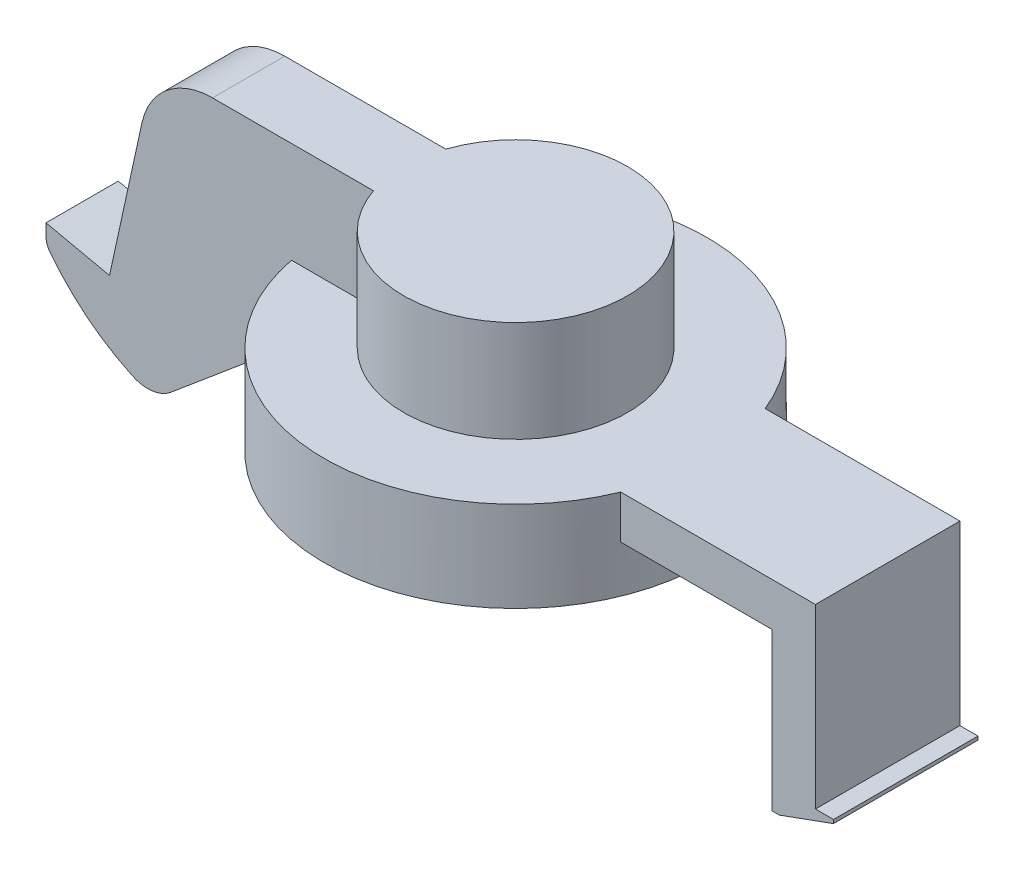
ISO-10303-21;
HEADER;
FILE_DESCRIPTION(('STEP AP214'),'2;1');
FILE_NAME('part.step','',(''),(''),'','','');
FILE_SCHEMA(('AUTOMOTIVE_DESIGN { 1 0 10303 214 1 1 1 1 }'));
ENDSEC;
DATA;
#1=APPLICATION_CONTEXT('core data for automotive mechanical design processes');
#2=APPLICATION_PROTOCOL_DEFINITION('international standard','automotive_design',2000,#1);
#3=PRODUCT_CONTEXT('',#1,'mechanical');
#4=PRODUCT('Part','Part','',(#3));
#5=PRODUCT_RELATED_PRODUCT_CATEGORY('part','',(#4));
#6=PRODUCT_DEFINITION_FORMATION('','',#4);
#7=PRODUCT_DEFINITION_CONTEXT('part definition',#1,'design');
#8=PRODUCT_DEFINITION('design','',#6,#7);
#9=PRODUCT_DEFINITION_SHAPE('','',#8);
#10=(LENGTH_UNIT() NAMED_UNIT(*) SI_UNIT(.MILLI.,.METRE.));
#11=(NAMED_UNIT(*) PLANE_ANGLE_UNIT() SI_UNIT($,.RADIAN.));
#12=(NAMED_UNIT(*) SI_UNIT($,.STERADIAN.) SOLID_ANGLE_UNIT());
#13=UNCERTAINTY_MEASURE_WITH_UNIT(LENGTH_MEASURE(1.E-05),#10,'distance_accuracy_value','');
#14=(GEOMETRIC_REPRESENTATION_CONTEXT(3) GLOBAL_UNCERTAINTY_ASSIGNED_CONTEXT((#13)) GLOBAL_UNIT_ASSIGNED_CONTEXT((#10,
#11,#12)) REPRESENTATION_CONTEXT('',''));
#15=CARTESIAN_POINT('',(0.,0.,0.));
#16=DIRECTION('',(0.,0.,1.));
#17=DIRECTION('',(1.,0.,0.));
#18=AXIS2_PLACEMENT_3D('',#15,#16,#17);
#19=CARTESIAN_POINT('',(10.8,-2.504045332,-2.));
#20=DIRECTION('',(-0.342020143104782,0.939692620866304,0.));
#21=DIRECTION('',(-0.939692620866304,-0.342020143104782,0.));
#22=AXIS2_PLACEMENT_3D('',#19,#20,#21);
#23=PLANE('',#22);
#24=DIRECTION('',(0.,0.,-1.));
#25=VECTOR('',#24,1.);
#26=CARTESIAN_POINT('',(9.3,-3.050000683,0.));
#27=LINE('',#26,#25);
#28=CARTESIAN_POINT('',(9.3,-3.050000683,2.));
#29=VERTEX_POINT('',#28);
#30=CARTESIAN_POINT('',(9.3,-3.050000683,-2.));
#31=VERTEX_POINT('',#30);
#32=EDGE_CURVE('E410',#29,#31,#27,.T.);
#33=ORIENTED_EDGE('',*,*,#32,.T.);
#34=DIRECTION('',(-0.939692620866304,-0.342020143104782,0.));
#35=VECTOR('',#34,1.);
#36=CARTESIAN_POINT('',(10.05,-2.7770230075,-2.));
#37=LINE('',#36,#35);
#38=CARTESIAN_POINT('',(10.8,-2.504045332,-2.));
#39=VERTEX_POINT('',#38);
#40=EDGE_CURVE('E429',#39,#31,#37,.T.);
#41=ORIENTED_EDGE('',*,*,#40,.F.);
#42=DIRECTION('',(0.,0.,1.));
#43=VECTOR('',#42,1.);
#44=CARTESIAN_POINT('',(10.8,-2.504045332,0.));
#45=LINE('',#44,#43);
#46=CARTESIAN_POINT('',(10.8,-2.504045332,2.));
#47=VERTEX_POINT('',#46);
#48=EDGE_CURVE('E416',#39,#47,#45,.T.);
#49=ORIENTED_EDGE('',*,*,#48,.T.);
#50=DIRECTION('',(0.939692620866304,0.342020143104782,0.));
#51=VECTOR('',#50,1.);
#52=CARTESIAN_POINT('',(10.05,-2.7770230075,2.));
#53=LINE('',#52,#51);
#54=EDGE_CURVE('E204',#29,#47,#53,.T.);
#55=ORIENTED_EDGE('',*,*,#54,.F.);
#56=EDGE_LOOP('',(#33,#41,#49,#55));
#57=FACE_BOUND('',#56,.T.);
#58=ADVANCED_FACE('F17',(#57),#23,.F.);
#59=CARTESIAN_POINT('',(-12.,-0.333947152,-1.));
#60=DIRECTION('',(1.,0.,0.));
#61=DIRECTION('',(0.,1.,0.));
#62=AXIS2_PLACEMENT_3D('',#59,#60,#61);
#63=PLANE('',#62);
#64=DIRECTION('',(0.,0.,-1.));
#65=VECTOR('',#64,1.);
#66=CARTESIAN_POINT('',(-12.,0.,0.));
#67=LINE('',#66,#65);
#68=CARTESIAN_POINT('',(-12.,1.10246295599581E-09,1.));
#69=VERTEX_POINT('',#68);
#70=CARTESIAN_POINT('',(-12.,0.,-1.));
#71=VERTEX_POINT('',#70);
#72=EDGE_CURVE('E205',#69,#71,#67,.T.);
#73=ORIENTED_EDGE('',*,*,#72,.T.);
#74=DIRECTION('',(0.,1.,0.));
#75=VECTOR('',#74,1.);
#76=CARTESIAN_POINT('',(-12.,-0.166973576,-1.));
#77=LINE('',#76,#75);
#78=CARTESIAN_POINT('',(-12.,-0.333947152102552,-1.));
#79=VERTEX_POINT('',#78);
#80=EDGE_CURVE('E202',#79,#71,#77,.T.);
#81=ORIENTED_EDGE('',*,*,#80,.F.);
#82=DIRECTION('',(0.,0.,-1.));
#83=VECTOR('',#82,1.);
#84=CARTESIAN_POINT('',(-12.,-0.333947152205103,0.));
#85=LINE('',#84,#83);
#86=CARTESIAN_POINT('',(-12.,-0.333947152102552,1.));
#87=VERTEX_POINT('',#86);
#88=EDGE_CURVE('E149',#79,#87,#85,.F.);
#89=ORIENTED_EDGE('',*,*,#88,.T.);
#90=DIRECTION('',(0.,-1.,0.));
#91=VECTOR('',#90,1.);
#92=CARTESIAN_POINT('',(-12.,-0.166973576,1.));
#93=LINE('',#92,#91);
#94=EDGE_CURVE('E152',#69,#87,#93,.T.);
#95=ORIENTED_EDGE('',*,*,#94,.F.);
#96=EDGE_LOOP('',(#73,#81,#89,#95));
#97=FACE_BOUND('',#96,.T.);
#98=ADVANCED_FACE('F254',(#97),#63,.F.);
#99=CARTESIAN_POINT('',(-11.5,-0.333947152,-1.));
#100=DIRECTION('',(0.,0.,1.));
#101=DIRECTION('',(1.,0.,0.));
#102=AXIS2_PLACEMENT_3D('',#99,#100,#101);
#103=CYLINDRICAL_SURFACE('',#102,0.5);
#104=ORIENTED_EDGE('',*,*,#88,.F.);
#105=CARTESIAN_POINT('',(-11.5,-0.333947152,-1.));
#106=DIRECTION('',(0.,0.,1.));
#107=DIRECTION('',(1.,0.,0.));
#108=AXIS2_PLACEMENT_3D('',#105,#106,#107);
#109=CIRCLE('',#108,0.5);
#110=CARTESIAN_POINT('',(-11.8963388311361,-0.638767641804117,-1.));
#111=VERTEX_POINT('',#110);
#112=EDGE_CURVE('E21',#111,#79,#109,.F.);
#113=ORIENTED_EDGE('',*,*,#112,.F.);
#114=DIRECTION('',(0.,0.,-1.));
#115=VECTOR('',#114,1.);
#116=CARTESIAN_POINT('',(-11.8963388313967,-0.638767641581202,0.));
#117=LINE('',#116,#115);
#118=CARTESIAN_POINT('',(-11.8963388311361,-0.638767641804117,1.));
#119=VERTEX_POINT('',#118);
#120=EDGE_CURVE('E146',#111,#119,#117,.F.);
#121=ORIENTED_EDGE('',*,*,#120,.T.);
#122=CARTESIAN_POINT('',(-11.5,-0.333947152,1.));
#123=DIRECTION('',(0.,0.,1.));
#124=DIRECTION('',(1.,0.,0.));
#125=AXIS2_PLACEMENT_3D('',#122,#123,#124);
#126=CIRCLE('',#125,0.5);
#127=EDGE_CURVE('E193',#87,#119,#126,.T.);
#128=ORIENTED_EDGE('',*,*,#127,.F.);
#129=EDGE_LOOP('',(#104,#113,#121,#128));
#130=FACE_BOUND('',#129,.T.);
#131=ADVANCED_FACE('F144',(#130),#103,.T.);
#132=CARTESIAN_POINT('',(-9.18440222,-1.566578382,-1.));
#133=DIRECTION('',(0.,0.,1.));
#134=DIRECTION('',(1.,0.,0.));
#135=AXIS2_PLACEMENT_3D('',#132,#133,#134);
#136=CYLINDRICAL_SURFACE('',#135,0.999999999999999);
#137=DIRECTION('',(0.,0.,1.));
#138=VECTOR('',#137,1.);
#139=CARTESIAN_POINT('',(-9.60634905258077,-2.47319895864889,0.));
#140=LINE('',#139,#138);
#141=CARTESIAN_POINT('',(-9.60634905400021,-2.47319895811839,1.));
#142=VERTEX_POINT('',#141);
#143=CARTESIAN_POINT('',(-9.60634905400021,-2.47319895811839,-1.));
#144=VERTEX_POINT('',#143);
#145=EDGE_CURVE('E161',#142,#144,#140,.F.);
#146=ORIENTED_EDGE('',*,*,#145,.T.);
#147=CARTESIAN_POINT('',(-9.18440222,-1.566578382,-1.));
#148=DIRECTION('',(0.,0.,1.));
#149=DIRECTION('',(1.,0.,0.));
#150=AXIS2_PLACEMENT_3D('',#147,#148,#149);
#151=CIRCLE('',#150,0.999999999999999);
#152=CARTESIAN_POINT('',(-8.54161461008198,-2.33262282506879,-1.));
#153=VERTEX_POINT('',#152);
#154=EDGE_CURVE('E165',#153,#144,#151,.F.);
#155=ORIENTED_EDGE('',*,*,#154,.F.);
#156=DIRECTION('',(0.,0.,1.));
#157=VECTOR('',#156,1.);
#158=CARTESIAN_POINT('',(-8.54161461,-2.332622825,0.));
#159=LINE('',#158,#157);
#160=CARTESIAN_POINT('',(-8.54161461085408,-2.33262282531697,1.));
#161=VERTEX_POINT('',#160);
#162=EDGE_CURVE('E462',#153,#161,#159,.T.);
#163=ORIENTED_EDGE('',*,*,#162,.T.);
#164=CARTESIAN_POINT('',(-9.18440222,-1.566578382,1.));
#165=DIRECTION('',(0.,0.,1.));
#166=DIRECTION('',(1.,0.,0.));
#167=AXIS2_PLACEMENT_3D('',#164,#165,#166);
#168=CIRCLE('',#167,0.999999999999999);
#169=EDGE_CURVE('E190',#142,#161,#168,.T.);
#170=ORIENTED_EDGE('',*,*,#169,.F.);
#171=EDGE_LOOP('',(#146,#155,#163,#170));
#172=FACE_BOUND('',#171,.T.);
#173=ADVANCED_FACE('F262',(#172),#136,.T.);
#174=CARTESIAN_POINT('',(10.8,-2.504045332,-2.));
#175=DIRECTION('',(-1.,0.,0.));
#176=DIRECTION('',(0.,0.,1.));
#177=AXIS2_PLACEMENT_3D('',#174,#175,#176);
#178=PLANE('',#177);
#179=ORIENTED_EDGE('',*,*,#48,.F.);
#180=DIRECTION('',(0.,-1.,0.));
#181=VECTOR('',#180,1.);
#182=CARTESIAN_POINT('',(10.8,-2.454045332,-2.));
#183=LINE('',#182,#181);
#184=CARTESIAN_POINT('',(10.8,-2.404045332,-2.));
#185=VERTEX_POINT('',#184);
#186=EDGE_CURVE('E192',#185,#39,#183,.T.);
#187=ORIENTED_EDGE('',*,*,#186,.F.);
#188=DIRECTION('',(0.,0.,1.));
#189=VECTOR('',#188,1.);
#190=CARTESIAN_POINT('',(10.8,-2.404045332,0.));
#191=LINE('',#190,#189);
#192=CARTESIAN_POINT('',(10.8,-2.40404533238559,2.));
#193=VERTEX_POINT('',#192);
#194=EDGE_CURVE('E461',#185,#193,#191,.T.);
#195=ORIENTED_EDGE('',*,*,#194,.T.);
#196=DIRECTION('',(0.,1.,0.));
#197=VECTOR('',#196,1.);
#198=CARTESIAN_POINT('',(10.8,-2.454045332,2.));
#199=LINE('',#198,#197);
#200=EDGE_CURVE('E413',#47,#193,#199,.T.);
#201=ORIENTED_EDGE('',*,*,#200,.F.);
#202=EDGE_LOOP('',(#179,#187,#195,#201));
#203=FACE_BOUND('',#202,.T.);
#204=ADVANCED_FACE('F258',(#203),#178,.F.);
#205=CARTESIAN_POINT('',(9.1,-3.050000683,-2.));
#206=DIRECTION('',(0.,1.,0.));
#207=DIRECTION('',(0.,0.,1.));
#208=AXIS2_PLACEMENT_3D('',#205,#206,#207);
#209=PLANE('',#208);
#210=DIRECTION('',(0.,0.,-1.));
#211=VECTOR('',#210,1.);
#212=CARTESIAN_POINT('',(9.1,-3.050000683,0.));
#213=LINE('',#212,#211);
#214=CARTESIAN_POINT('',(9.09999999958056,-3.050000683,2.));
#215=VERTEX_POINT('',#214);
#216=CARTESIAN_POINT('',(9.09999999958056,-3.050000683,-2.));
#217=VERTEX_POINT('',#216);
#218=EDGE_CURVE('E464',#215,#217,#213,.T.);
#219=ORIENTED_EDGE('',*,*,#218,.T.);
#220=DIRECTION('',(-1.,0.,0.));
#221=VECTOR('',#220,1.);
#222=CARTESIAN_POINT('',(9.2,-3.050000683,-2.));
#223=LINE('',#222,#221);
#224=EDGE_CURVE('E405',#31,#217,#223,.T.);
#225=ORIENTED_EDGE('',*,*,#224,.F.);
#226=ORIENTED_EDGE('',*,*,#32,.F.);
#227=DIRECTION('',(1.,0.,0.));
#228=VECTOR('',#227,1.);
#229=CARTESIAN_POINT('',(9.2,-3.050000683,2.));
#230=LINE('',#229,#228);
#231=EDGE_CURVE('E189',#215,#29,#230,.T.);
#232=ORIENTED_EDGE('',*,*,#231,.F.);
#233=EDGE_LOOP('',(#219,#225,#226,#232));
#234=FACE_BOUND('',#233,.T.);
#235=ADVANCED_FACE('F261',(#234),#209,.F.);
#236=CARTESIAN_POINT('',(-6.761702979,0.466307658,-1.));
#237=DIRECTION('',(0.,0.,1.));
#238=DIRECTION('',(1.,0.,0.));
#239=AXIS2_PLACEMENT_3D('',#236,#237,#238);
#240=CYLINDRICAL_SURFACE('',#239,1.);
#241=DIRECTION('',(0.,0.,-1.));
#242=VECTOR('',#241,1.);
#243=CARTESIAN_POINT('',(-6.118915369,-0.299736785,0.));
#244=LINE('',#243,#242);
#245=CARTESIAN_POINT('',(-6.1189153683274,-0.299736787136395,1.));
#246=VERTEX_POINT('',#245);
#247=CARTESIAN_POINT('',(-6.11891536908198,-0.299736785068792,-1.));
#248=VERTEX_POINT('',#247);
#249=EDGE_CURVE('E160',#246,#248,#244,.T.);
#250=ORIENTED_EDGE('',*,*,#249,.T.);
#251=CARTESIAN_POINT('',(-6.761702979,0.466307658,-1.));
#252=DIRECTION('',(0.,0.,1.));
#253=DIRECTION('',(1.,0.,0.));
#254=AXIS2_PLACEMENT_3D('',#251,#252,#253);
#255=CIRCLE('',#254,1.);
#256=CARTESIAN_POINT('',(-5.76170297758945,0.466307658,-1.));
#257=VERTEX_POINT('',#256);
#258=EDGE_CURVE('E187',#257,#248,#255,.F.);
#259=ORIENTED_EDGE('',*,*,#258,.F.);
#260=DIRECTION('',(0.,0.,1.));
#261=VECTOR('',#260,1.);
#262=CARTESIAN_POINT('',(-5.761702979,0.466307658,0.));
#263=LINE('',#262,#261);
#264=CARTESIAN_POINT('',(-5.76170297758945,0.466307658,1.));
#265=VERTEX_POINT('',#264);
#266=EDGE_CURVE('E482',#257,#265,#263,.T.);
#267=ORIENTED_EDGE('',*,*,#266,.T.);
#268=CARTESIAN_POINT('',(-6.761702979,0.466307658,1.));
#269=DIRECTION('',(0.,0.,1.));
#270=DIRECTION('',(1.,0.,0.));
#271=AXIS2_PLACEMENT_3D('',#268,#269,#270);
#272=CIRCLE('',#271,1.);
#273=EDGE_CURVE('E184',#246,#265,#272,.T.);
#274=ORIENTED_EDGE('',*,*,#273,.F.);
#275=EDGE_LOOP('',(#250,#259,#267,#274));
#276=FACE_BOUND('',#275,.T.);
#277=ADVANCED_FACE('F266',(#276),#240,.T.);
#278=CARTESIAN_POINT('',(-7.389671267,5.3,-3.1372));
#279=DIRECTION('',(0.,1.,0.));
#280=DIRECTION('',(0.,0.,1.));
#281=AXIS2_PLACEMENT_3D('',#278,#279,#280);
#282=PLANE('',#281);
#283=CARTESIAN_POINT('',(0.,5.3,0.));
#284=DIRECTION('',(0.,-1.,0.));
#285=DIRECTION('',(0.,0.,-1.));
#286=AXIS2_PLACEMENT_3D('',#283,#284,#285);
#287=CIRCLE('',#286,3.1);
#288=CARTESIAN_POINT('',(-2.93428015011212,5.3,1.));
#289=VERTEX_POINT('',#288);
#290=CARTESIAN_POINT('',(-2.93428015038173,5.3,-0.999999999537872));
#291=VERTEX_POINT('',#290);
#292=EDGE_CURVE('E558',#289,#291,#287,.F.);
#293=ORIENTED_EDGE('',*,*,#292,.T.);
#294=DIRECTION('',(-1.,0.,0.));
#295=VECTOR('',#294,1.);
#296=CARTESIAN_POINT('',(-7.467140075,5.3,-1.));
#297=LINE('',#296,#295);
#298=CARTESIAN_POINT('',(-7.3896712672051,5.3,-1.));
#299=VERTEX_POINT('',#298);
#300=EDGE_CURVE('E183',#291,#299,#297,.T.);
#301=ORIENTED_EDGE('',*,*,#300,.T.);
#302=DIRECTION('',(0.,0.,-1.));
#303=VECTOR('',#302,1.);
#304=CARTESIAN_POINT('',(-7.38967126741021,5.3,0.));
#305=LINE('',#304,#303);
#306=CARTESIAN_POINT('',(-7.3896712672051,5.3,1.));
#307=VERTEX_POINT('',#306);
#308=EDGE_CURVE('E186',#299,#307,#305,.F.);
#309=ORIENTED_EDGE('',*,*,#308,.T.);
#310=DIRECTION('',(-1.,0.,0.));
#311=VECTOR('',#310,1.);
#312=CARTESIAN_POINT('',(-7.467140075,5.3,1.));
#313=LINE('',#312,#311);
#314=EDGE_CURVE('E507',#289,#307,#313,.T.);
#315=ORIENTED_EDGE('',*,*,#314,.F.);
#316=EDGE_LOOP('',(#293,#301,#309,#315));
#317=FACE_BOUND('',#316,.T.);
#318=ADVANCED_FACE('F268',(#317),#282,.T.);
#319=CARTESIAN_POINT('',(-7.389671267,3.3,-1.));
#320=DIRECTION('',(0.,0.,1.));
#321=DIRECTION('',(1.,0.,0.));
#322=AXIS2_PLACEMENT_3D('',#319,#320,#321);
#323=CYLINDRICAL_SURFACE('',#322,2.);
#324=ORIENTED_EDGE('',*,*,#308,.F.);
#325=CARTESIAN_POINT('',(-7.389671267,3.3,-1.));
#326=DIRECTION('',(0.,0.,1.));
#327=DIRECTION('',(1.,0.,0.));
#328=AXIS2_PLACEMENT_3D('',#325,#326,#327);
#329=CIRCLE('',#328,2.);
#330=CARTESIAN_POINT('',(-9.3436102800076,3.7267579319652,-1.));
#331=VERTEX_POINT('',#330);
#332=EDGE_CURVE('E180',#299,#331,#329,.T.);
#333=ORIENTED_EDGE('',*,*,#332,.T.);
#334=DIRECTION('',(0.,0.,1.));
#335=VECTOR('',#334,1.);
#336=CARTESIAN_POINT('',(-9.34361028,3.726757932,0.));
#337=LINE('',#336,#335);
#338=CARTESIAN_POINT('',(-9.34361028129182,3.72675793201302,1.));
#339=VERTEX_POINT('',#338);
#340=EDGE_CURVE('E208',#331,#339,#337,.T.);
#341=ORIENTED_EDGE('',*,*,#340,.T.);
#342=CARTESIAN_POINT('',(-7.389671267,3.3,1.));
#343=DIRECTION('',(0.,0.,1.));
#344=DIRECTION('',(1.,0.,0.));
#345=AXIS2_PLACEMENT_3D('',#342,#343,#344);
#346=CIRCLE('',#345,2.);
#347=EDGE_CURVE('E509',#307,#339,#346,.T.);
#348=ORIENTED_EDGE('',*,*,#347,.F.);
#349=EDGE_LOOP('',(#324,#333,#341,#348));
#350=FACE_BOUND('',#349,.T.);
#351=ADVANCED_FACE('F271',(#350),#323,.T.);
#352=CARTESIAN_POINT('',(-10.241454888,-0.384082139,-1.));
#353=DIRECTION('',(0.976969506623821,-0.213378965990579,0.));
#354=DIRECTION('',(0.213378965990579,0.976969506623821,0.));
#355=AXIS2_PLACEMENT_3D('',#352,#353,#354);
#356=PLANE('',#355);
#357=ORIENTED_EDGE('',*,*,#340,.F.);
#358=DIRECTION('',(0.213378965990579,0.976969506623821,0.));
#359=VECTOR('',#358,1.);
#360=CARTESIAN_POINT('',(-10.241454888,-0.384082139,-1.));
#361=LINE('',#360,#359);
#362=CARTESIAN_POINT('',(-10.241454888,-0.384082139,-1.));
#363=VERTEX_POINT('',#362);
#364=EDGE_CURVE('E174',#331,#363,#361,.F.);
#365=ORIENTED_EDGE('',*,*,#364,.T.);
#366=DIRECTION('',(0.,0.,1.));
#367=VECTOR('',#366,1.);
#368=CARTESIAN_POINT('',(-10.241454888,-0.384082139,0.));
#369=LINE('',#368,#367);
#370=CARTESIAN_POINT('',(-10.2414548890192,-0.38408213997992,1.));
#371=VERTEX_POINT('',#370);
#372=EDGE_CURVE('E207',#363,#371,#369,.T.);
#373=ORIENTED_EDGE('',*,*,#372,.T.);
#374=DIRECTION('',(-0.213378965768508,-0.976969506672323,0.));
#375=VECTOR('',#374,1.);
#376=CARTESIAN_POINT('',(-9.34361028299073,3.72675793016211,1.));
#377=LINE('',#376,#375);
#378=EDGE_CURVE('E619',#339,#371,#377,.T.);
#379=ORIENTED_EDGE('',*,*,#378,.F.);
#380=EDGE_LOOP('',(#357,#365,#373,#379));
#381=FACE_BOUND('',#380,.T.);
#382=ADVANCED_FACE('F273',(#381),#356,.F.);
#383=CARTESIAN_POINT('',(-12.,0.,-1.));
#384=DIRECTION('',(-0.213378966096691,-0.976969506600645,0.));
#385=DIRECTION('',(0.976969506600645,-0.213378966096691,0.));
#386=AXIS2_PLACEMENT_3D('',#383,#384,#385);
#387=PLANE('',#386);
#388=ORIENTED_EDGE('',*,*,#372,.F.);
#389=DIRECTION('',(0.976969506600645,-0.213378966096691,0.));
#390=VECTOR('',#389,1.);
#391=CARTESIAN_POINT('',(-12.,0.,-1.));
#392=LINE('',#391,#390);
#393=EDGE_CURVE('E168',#363,#71,#392,.F.);
#394=ORIENTED_EDGE('',*,*,#393,.T.);
#395=ORIENTED_EDGE('',*,*,#72,.F.);
#396=DIRECTION('',(-0.976969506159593,0.213378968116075,0.));
#397=VECTOR('',#396,1.);
#398=CARTESIAN_POINT('',(-10.2414548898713,-0.38408214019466,1.));
#399=LINE('',#398,#397);
#400=EDGE_CURVE('E616',#371,#69,#399,.T.);
#401=ORIENTED_EDGE('',*,*,#400,.F.);
#402=EDGE_LOOP('',(#388,#394,#395,#401));
#403=FACE_BOUND('',#402,.T.);
#404=ADVANCED_FACE('F276',(#403),#387,.F.);
#405=CARTESIAN_POINT('',(-7.,3.126960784,-1.));
#406=DIRECTION('',(0.,0.,1.));
#407=DIRECTION('',(1.,0.,0.));
#408=AXIS2_PLACEMENT_3D('',#405,#406,#407);
#409=CYLINDRICAL_SURFACE('',#408,6.176960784);
#410=ORIENTED_EDGE('',*,*,#120,.F.);
#411=CARTESIAN_POINT('',(-7.,3.126960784,-1.));
#412=DIRECTION('',(0.,0.,1.));
#413=DIRECTION('',(1.,0.,0.));
#414=AXIS2_PLACEMENT_3D('',#411,#412,#413);
#415=CIRCLE('',#414,6.176960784);
#416=EDGE_CURVE('E157',#111,#144,#415,.T.);
#417=ORIENTED_EDGE('',*,*,#416,.T.);
#418=ORIENTED_EDGE('',*,*,#145,.F.);
#419=CARTESIAN_POINT('',(-7.,3.126960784,1.));
#420=DIRECTION('',(0.,0.,1.));
#421=DIRECTION('',(1.,0.,0.));
#422=AXIS2_PLACEMENT_3D('',#419,#420,#421);
#423=CIRCLE('',#422,6.176960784);
#424=EDGE_CURVE('E159',#119,#142,#423,.T.);
#425=ORIENTED_EDGE('',*,*,#424,.F.);
#426=EDGE_LOOP('',(#410,#417,#418,#425));
#427=FACE_BOUND('',#426,.T.);
#428=ADVANCED_FACE('F155',(#427),#409,.T.);
#429=CARTESIAN_POINT('',(-6.118915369,-0.299736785,-1.));
#430=DIRECTION('',(-0.642787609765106,0.766044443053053,0.));
#431=DIRECTION('',(-0.766044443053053,-0.642787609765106,0.));
#432=AXIS2_PLACEMENT_3D('',#429,#430,#431);
#433=PLANE('',#432);
#434=ORIENTED_EDGE('',*,*,#162,.F.);
#435=DIRECTION('',(-0.766044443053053,-0.642787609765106,0.));
#436=VECTOR('',#435,1.);
#437=CARTESIAN_POINT('',(-6.118915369,-0.299736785,-1.));
#438=LINE('',#437,#436);
#439=EDGE_CURVE('E167',#153,#248,#438,.F.);
#440=ORIENTED_EDGE('',*,*,#439,.T.);
#441=ORIENTED_EDGE('',*,*,#249,.F.);
#442=DIRECTION('',(0.766044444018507,0.642787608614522,0.));
#443=VECTOR('',#442,1.);
#444=CARTESIAN_POINT('',(-8.54161461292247,-2.33262282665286,1.));
#445=LINE('',#444,#443);
#446=EDGE_CURVE('E506',#161,#246,#445,.T.);
#447=ORIENTED_EDGE('',*,*,#446,.F.);
#448=EDGE_LOOP('',(#434,#440,#441,#447));
#449=FACE_BOUND('',#448,.T.);
#450=ADVANCED_FACE('F281',(#449),#433,.F.);
#451=CARTESIAN_POINT('',(10.3,-2.404045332,2.));
#452=DIRECTION('',(0.,-1.,0.));
#453=DIRECTION('',(0.,0.,-1.));
#454=AXIS2_PLACEMENT_3D('',#451,#452,#453);
#455=PLANE('',#454);
#456=ORIENTED_EDGE('',*,*,#194,.F.);
#457=DIRECTION('',(1.,0.,0.));
#458=VECTOR('',#457,1.);
#459=CARTESIAN_POINT('',(10.55,-2.404045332,-2.));
#460=LINE('',#459,#458);
#461=CARTESIAN_POINT('',(10.2999999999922,-2.40404533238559,-2.));
#462=VERTEX_POINT('',#461);
#463=EDGE_CURVE('E453',#462,#185,#460,.T.);
#464=ORIENTED_EDGE('',*,*,#463,.F.);
#465=DIRECTION('',(0.,0.,-1.));
#466=VECTOR('',#465,1.);
#467=CARTESIAN_POINT('',(10.3,-2.404045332,0.));
#468=LINE('',#467,#466);
#469=CARTESIAN_POINT('',(10.2999999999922,-2.40404533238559,2.));
#470=VERTEX_POINT('',#469);
#471=EDGE_CURVE('E544',#470,#462,#468,.T.);
#472=ORIENTED_EDGE('',*,*,#471,.F.);
#473=DIRECTION('',(-1.,0.,0.));
#474=VECTOR('',#473,1.);
#475=CARTESIAN_POINT('',(7.8540782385,-2.40404533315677,2.));
#476=LINE('',#475,#474);
#477=EDGE_CURVE('E473',#193,#470,#476,.T.);
#478=ORIENTED_EDGE('',*,*,#477,.F.);
#479=EDGE_LOOP('',(#456,#464,#472,#478));
#480=FACE_BOUND('',#479,.T.);
#481=ADVANCED_FACE('F284',(#480),#455,.F.);
#482=CARTESIAN_POINT('',(9.1,-3.050000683,2.));
#483=DIRECTION('',(1.,0.,0.));
#484=DIRECTION('',(0.,0.,-1.));
#485=AXIS2_PLACEMENT_3D('',#482,#483,#484);
#486=PLANE('',#485);
#487=DIRECTION('',(0.,0.,-1.));
#488=VECTOR('',#487,1.);
#489=CARTESIAN_POINT('',(9.1,1.3,0.));
#490=LINE('',#489,#488);
#491=CARTESIAN_POINT('',(9.09999999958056,1.3,2.));
#492=VERTEX_POINT('',#491);
#493=CARTESIAN_POINT('',(9.09999999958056,1.3,-2.));
#494=VERTEX_POINT('',#493);
#495=EDGE_CURVE('E514',#492,#494,#490,.T.);
#496=ORIENTED_EDGE('',*,*,#495,.T.);
#497=DIRECTION('',(0.,1.,0.));
#498=VECTOR('',#497,1.);
#499=CARTESIAN_POINT('',(9.09999999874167,-0.2750003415,-2.));
#500=LINE('',#499,#498);
#501=EDGE_CURVE('E542',#217,#494,#500,.T.);
#502=ORIENTED_EDGE('',*,*,#501,.F.);
#503=ORIENTED_EDGE('',*,*,#218,.F.);
#504=DIRECTION('',(0.,-1.,0.));
#505=VECTOR('',#504,1.);
#506=CARTESIAN_POINT('',(9.09999999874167,-0.2750003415,2.));
#507=LINE('',#506,#505);
#508=EDGE_CURVE('E477',#492,#215,#507,.T.);
#509=ORIENTED_EDGE('',*,*,#508,.F.);
#510=EDGE_LOOP('',(#496,#502,#503,#509));
#511=FACE_BOUND('',#510,.T.);
#512=ADVANCED_FACE('F288',(#511),#486,.F.);
#513=CARTESIAN_POINT('',(-5.761702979,0.466307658,-1.));
#514=DIRECTION('',(-1.,0.,0.));
#515=DIRECTION('',(0.,0.,1.));
#516=AXIS2_PLACEMENT_3D('',#513,#514,#515);
#517=PLANE('',#516);
#518=ORIENTED_EDGE('',*,*,#266,.F.);
#519=DIRECTION('',(0.,1.,0.));
#520=VECTOR('',#519,1.);
#521=CARTESIAN_POINT('',(-5.7617029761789,1.343111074,-1.));
#522=LINE('',#521,#520);
#523=CARTESIAN_POINT('',(-5.76170297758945,0.960769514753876,-1.));
#524=VERTEX_POINT('',#523);
#525=EDGE_CURVE('E171',#257,#524,#522,.T.);
#526=ORIENTED_EDGE('',*,*,#525,.T.);
#527=DIRECTION('',(0.,0.,1.));
#528=VECTOR('',#527,1.);
#529=CARTESIAN_POINT('',(-5.761702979,0.960769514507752,0.));
#530=LINE('',#529,#528);
#531=CARTESIAN_POINT('',(-5.76170297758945,0.960769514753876,1.));
#532=VERTEX_POINT('',#531);
#533=EDGE_CURVE('E561',#532,#524,#530,.F.);
#534=ORIENTED_EDGE('',*,*,#533,.F.);
#535=DIRECTION('',(0.,1.,0.));
#536=VECTOR('',#535,1.);
#537=CARTESIAN_POINT('',(-5.7617029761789,1.343111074,1.));
#538=LINE('',#537,#536);
#539=EDGE_CURVE('E504',#265,#532,#538,.T.);
#540=ORIENTED_EDGE('',*,*,#539,.F.);
#541=EDGE_LOOP('',(#518,#526,#534,#540));
#542=FACE_BOUND('',#541,.T.);
#543=ADVANCED_FACE('F292',(#542),#517,.F.);
#544=CARTESIAN_POINT('',(-12.,-2.613777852,-1.));
#545=DIRECTION('',(0.,0.,1.));
#546=DIRECTION('',(1.,0.,0.));
#547=AXIS2_PLACEMENT_3D('',#544,#545,#546);
#548=PLANE('',#547);
#549=DIRECTION('',(0.,1.,0.));
#550=VECTOR('',#549,1.);
#551=CARTESIAN_POINT('',(-5.20480546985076,1.343111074,-1.));
#552=LINE('',#551,#550);
#553=CARTESIAN_POINT('',(-5.20480547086,1.97389299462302,-1.));
#554=VERTEX_POINT('',#553);
#555=CARTESIAN_POINT('',(-5.20480547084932,2.5,-1.0000000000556));
#556=VERTEX_POINT('',#555);
#557=EDGE_CURVE('E495',#554,#556,#552,.T.);
#558=ORIENTED_EDGE('',*,*,#557,.F.);
#559=CARTESIAN_POINT('',(-4.561702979,0.960769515,-1.));
#560=DIRECTION('',(0.,0.,1.));
#561=DIRECTION('',(1.,0.,0.));
#562=AXIS2_PLACEMENT_3D('',#559,#560,#561);
#563=CIRCLE('',#562,1.2);
#564=EDGE_CURVE('E493',#524,#554,#563,.F.);
#565=ORIENTED_EDGE('',*,*,#564,.F.);
#566=ORIENTED_EDGE('',*,*,#525,.F.);
#567=ORIENTED_EDGE('',*,*,#258,.T.);
#568=ORIENTED_EDGE('',*,*,#439,.F.);
#569=ORIENTED_EDGE('',*,*,#154,.T.);
#570=ORIENTED_EDGE('',*,*,#416,.F.);
#571=ORIENTED_EDGE('',*,*,#112,.T.);
#572=ORIENTED_EDGE('',*,*,#80,.T.);
#573=ORIENTED_EDGE('',*,*,#393,.F.);
#574=ORIENTED_EDGE('',*,*,#364,.F.);
#575=ORIENTED_EDGE('',*,*,#332,.F.);
#576=ORIENTED_EDGE('',*,*,#300,.F.);
#577=DIRECTION('',(0.,1.,0.));
#578=VECTOR('',#577,1.);
#579=CARTESIAN_POINT('',(-2.93428015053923,3.9,-0.999999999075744));
#580=LINE('',#579,#578);
#581=CARTESIAN_POINT('',(-2.93428015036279,2.5,-0.999999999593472));
#582=VERTEX_POINT('',#581);
#583=EDGE_CURVE('E497',#291,#582,#580,.F.);
#584=ORIENTED_EDGE('',*,*,#583,.T.);
#585=DIRECTION('',(1.,0.,0.));
#586=VECTOR('',#585,1.);
#587=CARTESIAN_POINT('',(2.5010828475,2.5,-1.0000000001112));
#588=LINE('',#587,#586);
#589=EDGE_CURVE('E537',#556,#582,#588,.T.);
#590=ORIENTED_EDGE('',*,*,#589,.F.);
#591=EDGE_LOOP('',(#558,#565,#566,#567,#568,#569,#570,#571,#572,#573,#574,#575,#576,#584,#590));
#592=FACE_BOUND('',#591,.T.);
#593=ADVANCED_FACE('F163',(#592),#548,.F.);
#594=CARTESIAN_POINT('',(0.,5.3,0.));
#595=DIRECTION('',(0.,-1.,0.));
#596=DIRECTION('',(0.,0.,-1.));
#597=AXIS2_PLACEMENT_3D('',#594,#595,#596);
#598=CYLINDRICAL_SURFACE('',#597,3.1);
#599=ORIENTED_EDGE('',*,*,#292,.F.);
#600=DIRECTION('',(0.,1.,0.));
#601=VECTOR('',#600,1.);
#602=CARTESIAN_POINT('',(-2.93428015,1.343111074,1.));
#603=LINE('',#602,#601);
#604=CARTESIAN_POINT('',(-2.93428015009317,2.5,1.0000000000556));
#605=VERTEX_POINT('',#604);
#606=EDGE_CURVE('E510',#605,#289,#603,.T.);
#607=ORIENTED_EDGE('',*,*,#606,.F.);
#608=CARTESIAN_POINT('',(0.,2.5,0.));
#609=DIRECTION('',(0.,-1.,0.));
#610=DIRECTION('',(0.,0.,-1.));
#611=AXIS2_PLACEMENT_3D('',#608,#609,#610);
#612=CIRCLE('',#611,3.1);
#613=EDGE_CURVE('E536',#582,#605,#612,.T.);
#614=ORIENTED_EDGE('',*,*,#613,.F.);
#615=ORIENTED_EDGE('',*,*,#583,.F.);
#616=EDGE_LOOP('',(#599,#607,#614,#615));
#617=FACE_BOUND('',#616,.T.);
#618=ADVANCED_FACE('F299',(#617),#598,.T.);
#619=CARTESIAN_POINT('',(-12.,-2.613777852,1.));
#620=DIRECTION('',(0.,0.,1.));
#621=DIRECTION('',(1.,0.,0.));
#622=AXIS2_PLACEMENT_3D('',#619,#620,#621);
#623=PLANE('',#622);
#624=CARTESIAN_POINT('',(-4.561702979,0.960769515,1.));
#625=DIRECTION('',(0.,0.,1.));
#626=DIRECTION('',(1.,0.,0.));
#627=AXIS2_PLACEMENT_3D('',#624,#625,#626);
#628=CIRCLE('',#627,1.2);
#629=CARTESIAN_POINT('',(-5.20480547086,1.97389299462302,1.));
#630=VERTEX_POINT('',#629);
#631=EDGE_CURVE('E563',#630,#532,#628,.T.);
#632=ORIENTED_EDGE('',*,*,#631,.F.);
#633=DIRECTION('',(0.,1.,0.));
#634=VECTOR('',#633,1.);
#635=CARTESIAN_POINT('',(-5.20480546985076,1.343111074,1.));
#636=LINE('',#635,#634);
#637=CARTESIAN_POINT('',(-5.20480547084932,2.5,1.0000000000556));
#638=VERTEX_POINT('',#637);
#639=EDGE_CURVE('E36',#630,#638,#636,.T.);
#640=ORIENTED_EDGE('',*,*,#639,.T.);
#641=DIRECTION('',(-1.,0.,0.));
#642=VECTOR('',#641,1.);
#643=CARTESIAN_POINT('',(2.5010828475,2.5,1.0000000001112));
#644=LINE('',#643,#642);
#645=EDGE_CURVE('E532',#605,#638,#644,.T.);
#646=ORIENTED_EDGE('',*,*,#645,.F.);
#647=ORIENTED_EDGE('',*,*,#606,.T.);
#648=ORIENTED_EDGE('',*,*,#314,.T.);
#649=ORIENTED_EDGE('',*,*,#347,.T.);
#650=ORIENTED_EDGE('',*,*,#378,.T.);
#651=ORIENTED_EDGE('',*,*,#400,.T.);
#652=ORIENTED_EDGE('',*,*,#94,.T.);
#653=ORIENTED_EDGE('',*,*,#127,.T.);
#654=ORIENTED_EDGE('',*,*,#424,.T.);
#655=ORIENTED_EDGE('',*,*,#169,.T.);
#656=ORIENTED_EDGE('',*,*,#446,.T.);
#657=ORIENTED_EDGE('',*,*,#273,.T.);
#658=ORIENTED_EDGE('',*,*,#539,.T.);
#659=EDGE_LOOP('',(#632,#640,#646,#647,#648,#649,#650,#651,#652,#653,#654,#655,#656,#657,#658));
#660=FACE_BOUND('',#659,.T.);
#661=ADVANCED_FACE('F300',(#660),#623,.T.);
#662=CARTESIAN_POINT('',(4.908156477,-3.050000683,2.));
#663=DIRECTION('',(0.,0.,1.));
#664=DIRECTION('',(1.,0.,0.));
#665=AXIS2_PLACEMENT_3D('',#662,#663,#664);
#666=PLANE('',#665);
#667=ORIENTED_EDGE('',*,*,#477,.T.);
#668=DIRECTION('',(0.,-1.,0.));
#669=VECTOR('',#668,1.);
#670=CARTESIAN_POINT('',(10.3,0.0479773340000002,2.));
#671=LINE('',#670,#669);
#672=CARTESIAN_POINT('',(10.3,2.5,2.00000000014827));
#673=VERTEX_POINT('',#672);
#674=EDGE_CURVE('E476',#673,#470,#671,.T.);
#675=ORIENTED_EDGE('',*,*,#674,.F.);
#676=DIRECTION('',(1.,0.,0.));
#677=VECTOR('',#676,1.);
#678=CARTESIAN_POINT('',(2.5010828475,2.5,2.0000000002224));
#679=LINE('',#678,#677);
#680=CARTESIAN_POINT('',(4.90815647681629,2.5,2.0000000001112));
#681=VERTEX_POINT('',#680);
#682=EDGE_CURVE('E529',#681,#673,#679,.T.);
#683=ORIENTED_EDGE('',*,*,#682,.F.);
#684=DIRECTION('',(0.,-1.,0.));
#685=VECTOR('',#684,1.);
#686=CARTESIAN_POINT('',(4.908156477,-0.2750003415,2.));
#687=LINE('',#686,#685);
#688=CARTESIAN_POINT('',(4.90815647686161,1.3,2.));
#689=VERTEX_POINT('',#688);
#690=EDGE_CURVE('E503',#681,#689,#687,.T.);
#691=ORIENTED_EDGE('',*,*,#690,.T.);
#692=DIRECTION('',(1.,0.,0.));
#693=VECTOR('',#692,1.);
#694=CARTESIAN_POINT('',(6.991502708,1.3,2.));
#695=LINE('',#694,#693);
#696=EDGE_CURVE('E511',#689,#492,#695,.T.);
#697=ORIENTED_EDGE('',*,*,#696,.T.);
#698=ORIENTED_EDGE('',*,*,#508,.T.);
#699=ORIENTED_EDGE('',*,*,#231,.T.);
#700=ORIENTED_EDGE('',*,*,#54,.T.);
#701=ORIENTED_EDGE('',*,*,#200,.T.);
#702=EDGE_LOOP('',(#667,#675,#683,#691,#697,#698,#699,#700,#701));
#703=FACE_BOUND('',#702,.T.);
#704=ADVANCED_FACE('F303',(#703),#666,.T.);
#705=CARTESIAN_POINT('',(10.3,-2.404045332,2.));
#706=DIRECTION('',(1.,0.,0.));
#707=DIRECTION('',(0.,0.,-1.));
#708=AXIS2_PLACEMENT_3D('',#705,#706,#707);
#709=PLANE('',#708);
#710=ORIENTED_EDGE('',*,*,#471,.T.);
#711=DIRECTION('',(0.,-1.,0.));
#712=VECTOR('',#711,1.);
#713=CARTESIAN_POINT('',(10.2999999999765,-0.2750003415,-2.));
#714=LINE('',#713,#712);
#715=CARTESIAN_POINT('',(10.2999999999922,2.5,-2.00000000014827));
#716=VERTEX_POINT('',#715);
#717=EDGE_CURVE('E457',#716,#462,#714,.T.);
#718=ORIENTED_EDGE('',*,*,#717,.F.);
#719=DIRECTION('',(0.,0.,-1.));
#720=VECTOR('',#719,1.);
#721=CARTESIAN_POINT('',(10.3,2.5,0.));
#722=LINE('',#721,#720);
#723=EDGE_CURVE('E526',#673,#716,#722,.T.);
#724=ORIENTED_EDGE('',*,*,#723,.F.);
#725=ORIENTED_EDGE('',*,*,#674,.T.);
#726=EDGE_LOOP('',(#710,#718,#724,#725));
#727=FACE_BOUND('',#726,.T.);
#728=ADVANCED_FACE('F306',(#727),#709,.T.);
#729=CARTESIAN_POINT('',(10.8,-3.050000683,-2.));
#730=DIRECTION('',(0.,0.,-1.));
#731=DIRECTION('',(-1.,0.,0.));
#732=AXIS2_PLACEMENT_3D('',#729,#730,#731);
#733=PLANE('',#732);
#734=DIRECTION('',(-1.,0.,0.));
#735=VECTOR('',#734,1.);
#736=CARTESIAN_POINT('',(6.991502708,1.3,-2.));
#737=LINE('',#736,#735);
#738=CARTESIAN_POINT('',(4.90815647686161,1.3,-2.));
#739=VERTEX_POINT('',#738);
#740=EDGE_CURVE('E515',#494,#739,#737,.T.);
#741=ORIENTED_EDGE('',*,*,#740,.T.);
#742=DIRECTION('',(0.,1.,0.));
#743=VECTOR('',#742,1.);
#744=CARTESIAN_POINT('',(4.908156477,-0.2750003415,-2.));
#745=LINE('',#744,#743);
#746=CARTESIAN_POINT('',(4.90815647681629,2.5,-2.0000000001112));
#747=VERTEX_POINT('',#746);
#748=EDGE_CURVE('E519',#739,#747,#745,.T.);
#749=ORIENTED_EDGE('',*,*,#748,.T.);
#750=DIRECTION('',(-1.,0.,0.));
#751=VECTOR('',#750,1.);
#752=CARTESIAN_POINT('',(2.5010828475,2.5,-2.0000000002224));
#753=LINE('',#752,#751);
#754=EDGE_CURVE('E522',#716,#747,#753,.T.);
#755=ORIENTED_EDGE('',*,*,#754,.F.);
#756=ORIENTED_EDGE('',*,*,#717,.T.);
#757=ORIENTED_EDGE('',*,*,#463,.T.);
#758=ORIENTED_EDGE('',*,*,#186,.T.);
#759=ORIENTED_EDGE('',*,*,#40,.T.);
#760=ORIENTED_EDGE('',*,*,#224,.T.);
#761=ORIENTED_EDGE('',*,*,#501,.T.);
#762=EDGE_LOOP('',(#741,#749,#755,#756,#757,#758,#759,#760,#761));
#763=FACE_BOUND('',#762,.T.);
#764=ADVANCED_FACE('F310',(#763),#733,.T.);
#765=CARTESIAN_POINT('',(4.883005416,1.3,-2.));
#766=DIRECTION('',(0.,1.,0.));
#767=DIRECTION('',(0.,0.,1.));
#768=AXIS2_PLACEMENT_3D('',#765,#766,#767);
#769=PLANE('',#768);
#770=ORIENTED_EDGE('',*,*,#696,.F.);
#771=CARTESIAN_POINT('',(0.,1.3,0.));
#772=DIRECTION('',(0.,-1.,0.));
#773=DIRECTION('',(1.,0.,0.));
#774=AXIS2_PLACEMENT_3D('',#771,#772,#773);
#775=CIRCLE('',#774,5.3);
#776=EDGE_CURVE('E525',#689,#739,#775,.F.);
#777=ORIENTED_EDGE('',*,*,#776,.T.);
#778=ORIENTED_EDGE('',*,*,#740,.F.);
#779=ORIENTED_EDGE('',*,*,#495,.F.);
#780=EDGE_LOOP('',(#770,#777,#778,#779));
#781=FACE_BOUND('',#780,.T.);
#782=ADVANCED_FACE('F314',(#781),#769,.F.);
#783=CARTESIAN_POINT('',(-4.561702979,0.960769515,-1.));
#784=DIRECTION('',(0.,0.,1.));
#785=DIRECTION('',(1.,0.,0.));
#786=AXIS2_PLACEMENT_3D('',#783,#784,#785);
#787=CYLINDRICAL_SURFACE('',#786,1.2);
#788=ORIENTED_EDGE('',*,*,#533,.T.);
#789=ORIENTED_EDGE('',*,*,#564,.T.);
#790=CARTESIAN_POINT('',(-5.20480547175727,1.97389299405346,-1.00000000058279));
#791=CARTESIAN_POINT('',(-5.21663358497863,1.9663822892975,-0.938433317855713));
#792=CARTESIAN_POINT('',(-5.22737871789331,1.95927432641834,-0.876613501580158));
#793=CARTESIAN_POINT('',(-5.24668295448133,1.94613192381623,-0.752506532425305));
#794=CARTESIAN_POINT('',(-5.25524156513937,1.94009772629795,-0.690219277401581));
#795=CARTESIAN_POINT('',(-5.27760516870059,1.92400936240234,-0.502715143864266));
#796=CARTESIAN_POINT('',(-5.28809005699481,1.91597476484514,-0.376896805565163));
#797=CARTESIAN_POINT('',(-5.29992691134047,1.90685712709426,-0.126990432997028));
#798=CARTESIAN_POINT('',(-5.30144900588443,1.90564461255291,-0.00291507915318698));
#799=CARTESIAN_POINT('',(-5.29578978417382,1.9100477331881,0.244844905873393));
#800=CARTESIAN_POINT('',(-5.28861454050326,1.91565860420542,0.368529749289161));
#801=CARTESIAN_POINT('',(-5.27318772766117,1.9271081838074,0.53415815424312));
#802=CARTESIAN_POINT('',(-5.26870700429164,1.93039950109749,0.576674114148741));
#803=CARTESIAN_POINT('',(-5.25872615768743,1.93759980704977,0.661530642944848));
#804=CARTESIAN_POINT('',(-5.25322617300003,1.94150871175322,0.703871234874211));
#805=CARTESIAN_POINT('',(-5.2411727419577,1.94989790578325,0.788640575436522));
#806=CARTESIAN_POINT('',(-5.23461238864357,1.95438189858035,0.831067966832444));
#807=CARTESIAN_POINT('',(-5.22047193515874,1.96381251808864,0.91570385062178));
#808=CARTESIAN_POINT('',(-5.21289176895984,1.96875917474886,0.95791232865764));
#809=CARTESIAN_POINT('',(-5.20480547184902,1.97389299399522,1.00000000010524));
#810=B_SPLINE_CURVE_WITH_KNOTS('',3,(#790,#791,#792,#793,#794,#795,#796,#797,#798,#799,#800,
#801,#802,#803,#804,#805,#806,#807,#808,#809),.UNSPECIFIED.,.F.,.F.,(4,2,2,2,2,2,2,2,2,4),(0.,
0.189401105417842,0.378844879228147,0.757858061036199,1.12965315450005,1.50118880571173,
1.62981251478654,1.75841875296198,1.88789921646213,2.01738806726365),.UNSPECIFIED.);
#811=EDGE_CURVE('E223',#554,#630,#810,.T.);
#812=ORIENTED_EDGE('',*,*,#811,.T.);
#813=ORIENTED_EDGE('',*,*,#631,.T.);
#814=EDGE_LOOP('',(#788,#789,#812,#813));
#815=FACE_BOUND('',#814,.T.);
#816=ADVANCED_FACE('F233',(#815),#787,.F.);
#817=CARTESIAN_POINT('',(-5.297834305,2.5,-5.3636));
#818=DIRECTION('',(0.,1.,0.));
#819=DIRECTION('',(0.,0.,1.));
#820=AXIS2_PLACEMENT_3D('',#817,#818,#819);
#821=PLANE('',#820);
#822=ORIENTED_EDGE('',*,*,#754,.T.);
#823=CARTESIAN_POINT('',(0.,2.5,0.));
#824=DIRECTION('',(0.,-1.,0.));
#825=DIRECTION('',(1.,0.,0.));
#826=AXIS2_PLACEMENT_3D('',#823,#824,#825);
#827=CIRCLE('',#826,5.3);
#828=EDGE_CURVE('E231',#747,#556,#827,.F.);
#829=ORIENTED_EDGE('',*,*,#828,.T.);
#830=ORIENTED_EDGE('',*,*,#589,.T.);
#831=ORIENTED_EDGE('',*,*,#613,.T.);
#832=ORIENTED_EDGE('',*,*,#645,.T.);
#833=CARTESIAN_POINT('',(0.,2.5,0.));
#834=DIRECTION('',(0.,-1.,0.));
#835=DIRECTION('',(1.,0.,0.));
#836=AXIS2_PLACEMENT_3D('',#833,#834,#835);
#837=CIRCLE('',#836,5.3);
#838=EDGE_CURVE('E221',#638,#681,#837,.F.);
#839=ORIENTED_EDGE('',*,*,#838,.T.);
#840=ORIENTED_EDGE('',*,*,#682,.T.);
#841=ORIENTED_EDGE('',*,*,#723,.T.);
#842=EDGE_LOOP('',(#822,#829,#830,#831,#832,#839,#840,#841));
#843=FACE_BOUND('',#842,.T.);
#844=ADVANCED_FACE('F241',(#843),#821,.T.);
#845=CARTESIAN_POINT('',(0.,2.5,0.));
#846=DIRECTION('',(0.,-1.,0.));
#847=DIRECTION('',(1.,0.,0.));
#848=AXIS2_PLACEMENT_3D('',#845,#846,#847);
#849=CYLINDRICAL_SURFACE('',#848,5.3);
#850=ORIENTED_EDGE('',*,*,#828,.F.);
#851=ORIENTED_EDGE('',*,*,#748,.F.);
#852=ORIENTED_EDGE('',*,*,#776,.F.);
#853=ORIENTED_EDGE('',*,*,#690,.F.);
#854=ORIENTED_EDGE('',*,*,#838,.F.);
#855=ORIENTED_EDGE('',*,*,#639,.F.);
#856=ORIENTED_EDGE('',*,*,#811,.F.);
#857=ORIENTED_EDGE('',*,*,#557,.T.);
#858=EDGE_LOOP('',(#850,#851,#852,#853,#854,#855,#856,#857));
#859=FACE_BOUND('',#858,.T.);
#860=CARTESIAN_POINT('',(0.,0.,0.));
#861=DIRECTION('',(0.,-1.,0.));
#862=DIRECTION('',(1.,0.,0.));
#863=AXIS2_PLACEMENT_3D('',#860,#861,#862);
#864=CIRCLE('',#863,5.3);
#865=CARTESIAN_POINT('',(5.3,0.,0.));
#866=VERTEX_POINT('',#865);
#867=EDGE_CURVE('E218',#866,#866,#864,.T.);
#868=ORIENTED_EDGE('',*,*,#867,.F.);
#869=EDGE_LOOP('',(#868));
#870=FACE_BOUND('',#869,.T.);
#871=ADVANCED_FACE('F236',(#859,#870),#849,.T.);
#872=CARTESIAN_POINT('',(-5.3636,0.,5.3636));
#873=DIRECTION('',(0.,-1.,0.));
#874=DIRECTION('',(0.,0.,-1.));
#875=AXIS2_PLACEMENT_3D('',#872,#873,#874);
#876=PLANE('',#875);
#877=CARTESIAN_POINT('',(0.,0.,0.));
#878=DIRECTION('',(0.,-1.,0.));
#879=DIRECTION('',(0.,0.,-1.));
#880=AXIS2_PLACEMENT_3D('',#877,#878,#879);
#881=CIRCLE('',#880,4.);
#882=CARTESIAN_POINT('',(0.,0.,-4.));
#883=VERTEX_POINT('',#882);
#884=EDGE_CURVE('E215',#883,#883,#881,.T.);
#885=ORIENTED_EDGE('',*,*,#884,.F.);
#886=EDGE_LOOP('',(#885));
#887=FACE_BOUND('',#886,.T.);
#888=ORIENTED_EDGE('',*,*,#867,.T.);
#889=EDGE_LOOP('',(#888));
#890=FACE_BOUND('',#889,.T.);
#891=ADVANCED_FACE('F240',(#887,#890),#876,.T.);
#892=CARTESIAN_POINT('',(0.,1.5,0.));
#893=DIRECTION('',(0.,-1.,0.));
#894=DIRECTION('',(0.,0.,-1.));
#895=AXIS2_PLACEMENT_3D('',#892,#893,#894);
#896=CYLINDRICAL_SURFACE('',#895,4.);
#897=ORIENTED_EDGE('',*,*,#884,.T.);
#898=EDGE_LOOP('',(#897));
#899=FACE_BOUND('',#898,.T.);
#900=CARTESIAN_POINT('',(0.,1.5,0.));
#901=DIRECTION('',(0.,-1.,0.));
#902=DIRECTION('',(0.,0.,-1.));
#903=AXIS2_PLACEMENT_3D('',#900,#901,#902);
#904=CIRCLE('',#903,4.);
#905=CARTESIAN_POINT('',(0.,1.5,-4.));
#906=VERTEX_POINT('',#905);
#907=EDGE_CURVE('E212',#906,#906,#904,.T.);
#908=ORIENTED_EDGE('',*,*,#907,.F.);
#909=EDGE_LOOP('',(#908));
#910=FACE_BOUND('',#909,.T.);
#911=ADVANCED_FACE('F243',(#899,#910),#896,.F.);
#912=CARTESIAN_POINT('',(-1.8216,4.,1.8216));
#913=DIRECTION('',(0.,-1.,0.));
#914=DIRECTION('',(0.,0.,-1.));
#915=AXIS2_PLACEMENT_3D('',#912,#913,#914);
#916=PLANE('',#915);
#917=CARTESIAN_POINT('',(0.,4.,0.));
#918=DIRECTION('',(0.,-1.,0.));
#919=DIRECTION('',(0.,0.,-1.));
#920=AXIS2_PLACEMENT_3D('',#917,#918,#919);
#921=CIRCLE('',#920,1.8);
#922=CARTESIAN_POINT('',(0.,4.,-1.8));
#923=VERTEX_POINT('',#922);
#924=EDGE_CURVE('E27',#923,#923,#921,.F.);
#925=ORIENTED_EDGE('',*,*,#924,.F.);
#926=EDGE_LOOP('',(#925));
#927=FACE_BOUND('',#926,.T.);
#928=ADVANCED_FACE('F246',(#927),#916,.T.);
#929=CARTESIAN_POINT('',(-4.048,1.5,4.048));
#930=DIRECTION('',(0.,-1.,0.));
#931=DIRECTION('',(0.,0.,-1.));
#932=AXIS2_PLACEMENT_3D('',#929,#930,#931);
#933=PLANE('',#932);
#934=CARTESIAN_POINT('',(0.,1.5,0.));
#935=DIRECTION('',(0.,-1.,0.));
#936=DIRECTION('',(0.,0.,-1.));
#937=AXIS2_PLACEMENT_3D('',#934,#935,#936);
#938=CIRCLE('',#937,1.8);
#939=CARTESIAN_POINT('',(0.,1.5,-1.8));
#940=VERTEX_POINT('',#939);
#941=EDGE_CURVE('E11',#940,#940,#938,.T.);
#942=ORIENTED_EDGE('',*,*,#941,.F.);
#943=EDGE_LOOP('',(#942));
#944=FACE_BOUND('',#943,.T.);
#945=ORIENTED_EDGE('',*,*,#907,.T.);
#946=EDGE_LOOP('',(#945));
#947=FACE_BOUND('',#946,.T.);
#948=ADVANCED_FACE('F19',(#944,#947),#933,.T.);
#949=CARTESIAN_POINT('',(0.,4.,0.));
#950=DIRECTION('',(0.,-1.,0.));
#951=DIRECTION('',(0.,0.,-1.));
#952=AXIS2_PLACEMENT_3D('',#949,#950,#951);
#953=CYLINDRICAL_SURFACE('',#952,1.8);
#954=ORIENTED_EDGE('',*,*,#941,.T.);
#955=EDGE_LOOP('',(#954));
#956=FACE_BOUND('',#955,.T.);
#957=ORIENTED_EDGE('',*,*,#924,.T.);
#958=EDGE_LOOP('',(#957));
#959=FACE_BOUND('',#958,.T.);
#960=ADVANCED_FACE('F248',(#956,#959),#953,.F.);
#961=CLOSED_SHELL('',(#58,#98,#131,#173,#204,#235,#277,#318,#351,#382,#404,#428,#450,#481,#512,
#543,#593,#618,#661,#704,#728,#764,#782,#816,#844,#871,#891,#911,#928,#948,#960));
#962=MANIFOLD_SOLID_BREP('B1',#961);
#963=ADVANCED_BREP_SHAPE_REPRESENTATION('',(#18,#962),#14);
#964=SHAPE_DEFINITION_REPRESENTATION(#9,#963);
ENDSEC;
END-ISO-10303-21;
